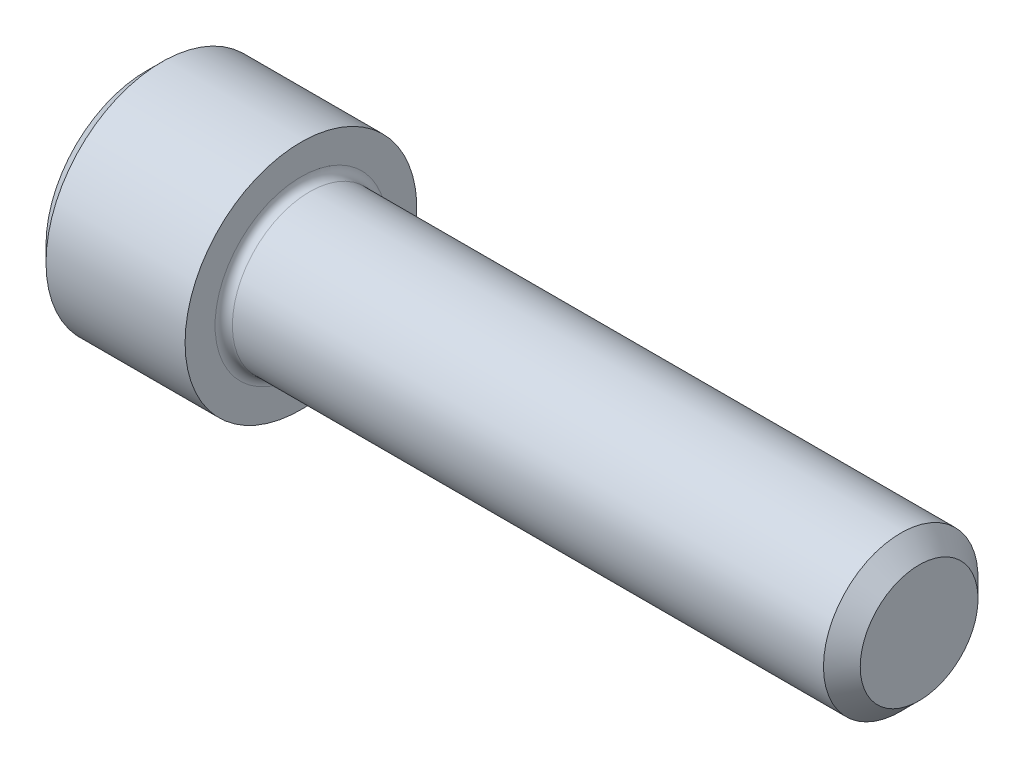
from build123d import *

# Parameters (mm, degrees)
FILLET1_R   = 0.3556
HEX_2_DEPTH = 3.048


with BuildPart() as part:
    # BodySke → Base-Revolve (revolve)
    with BuildSketch(Plane.XY, mode=Mode.PRIVATE) as base_revolve_sk:
        Polygon((0, 0), (0, 4.1275), (0.635, 4.7625), (6.35, 4.7625), (6.35, 3.175), (30.99435, 3.175), (31.75, 2.41935), (31.75, 0), align=None)
    revolve(base_revolve_sk.sketch.rotate(Axis((-31.75, 0, 0), (1, 0, 0)), 90), axis=Axis((-31.75, 0, 0), (1, 0, 0)))

    # Fillet1
    fillet1_edges = [part.edges().sort_by_distance(p)[0] for p in [
        (6.35, 0, -3.175),
    ]]
    fillet(fillet1_edges, radius=FILLET1_R)

    # Sketch2 → Hex-PreBroach (revolve, cut)
    with BuildSketch(Plane.XY, mode=Mode.PRIVATE) as hex_prebroach_sk:
        Polygon((0, 2.38125), (3.048, 2.38125), (4.422815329, 0), (0, 0), align=None)
    revolve(hex_prebroach_sk.sketch.rotate(Axis((0, 0, 0), (1, 0, 0)), 90), axis=Axis((0, 0, 0), (1, 0, 0)), mode=Mode.SUBTRACT)

    # Sketch3 → Hex 2 (cut)
    with BuildSketch(Plane(origin=(0, 0, 0), x_dir=(0, 0.500000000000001, 0.866025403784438), z_dir=(-1, 0, 0))):
        Polygon((1.374815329, 2.38125), (-1.374815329, 2.38125), (-2.749630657, 0), (-1.374815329, -2.38125), (1.374815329, -2.38125), (2.749630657, 0), align=None)
    extrude(amount=-HEX_2_DEPTH, mode=Mode.SUBTRACT)


solid = part.part
